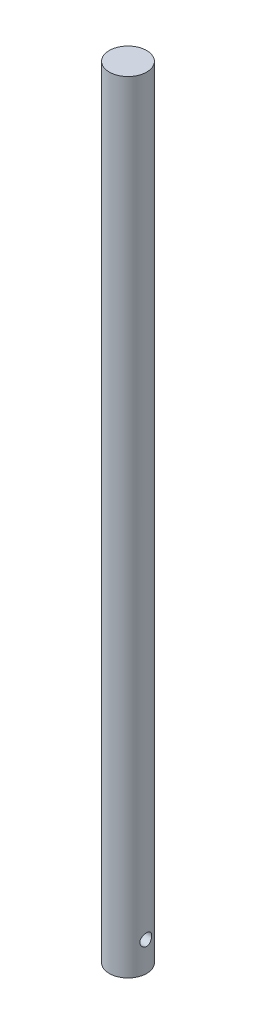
from build123d import *

# Parameters (mm, degrees)
SKETCH1_R                           = 12.7
EXTRUDE1_DEPTH                      = 530
CUT_EXTRUDE1_REACH                  = 532.304
CUT_EXTRUDE1_END_RADIUS             = 12.7
SKETCH2_R                           = 4
CUT_EXTRUDE1_DIRECTION_2_REACH      = 532.304
CUT_EXTRUDE1_DIRECTION_2_END_RADIUS = 12.7


with BuildPart() as part:
    # Sketch1 → Extrude1 (new body)
    with BuildSketch(Plane(origin=(0, 0, 0), x_dir=(1, 0, 0), z_dir=(0, 1, 0))):
        with Locations(Location((0, 0, 0), (0, 0, 270))):
            Circle(SKETCH1_R)
    extrude(amount=EXTRUDE1_DEPTH)

    # Cut-Extrude1: up to this cylinder (the profile starts inside it)
    cut_extrude1_end = Plane(origin=(0, 20, 0), z_dir=(0, -1, 0)) * Cylinder(CUT_EXTRUDE1_END_RADIUS, 1091.008, mode=Mode.PRIVATE)
    # Sketch2 → Cut-Extrude1 (cut, up to the surface)
    with BuildSketch(Plane(origin=(0, 0, 0), x_dir=(0, 0, -1), z_dir=(1, 0, 0)), mode=Mode.PRIVATE) as cut_extrude1_sk1:
        with Locations((0, 20)):
            Circle(SKETCH2_R)
    cut_extrude1_tool1 = extrude(cut_extrude1_sk1.sketch, amount=-CUT_EXTRUDE1_REACH, mode=Mode.PRIVATE) & cut_extrude1_end
    add(cut_extrude1_tool1.solids().sort_by_distance((0, 20, 0))[0], mode=Mode.SUBTRACT)

    # Cut-Extrude1 direction 2: up to this cylinder (the profile starts inside it)
    cut_extrude1_direction_2_end = Plane(origin=(0, 20, 0), z_dir=(0, -1, 0)) * Cylinder(CUT_EXTRUDE1_DIRECTION_2_END_RADIUS, 1091.008, mode=Mode.PRIVATE)
    # Sketch2 → Cut-Extrude1 direction 2 (cut, up to the surface)
    with BuildSketch(Plane(origin=(0, 0, 0), x_dir=(0, 0, -1), z_dir=(1, 0, 0)), mode=Mode.PRIVATE) as cut_extrude1_direction_2_sk1:
        with Locations((0, 20)):
            Circle(SKETCH2_R)
    cut_extrude1_direction_2_tool1 = extrude(cut_extrude1_direction_2_sk1.sketch, amount=CUT_EXTRUDE1_DIRECTION_2_REACH, mode=Mode.PRIVATE) & cut_extrude1_direction_2_end
    add(cut_extrude1_direction_2_tool1.solids().sort_by_distance((0, 20, 0))[0], mode=Mode.SUBTRACT)


solid = part.part
